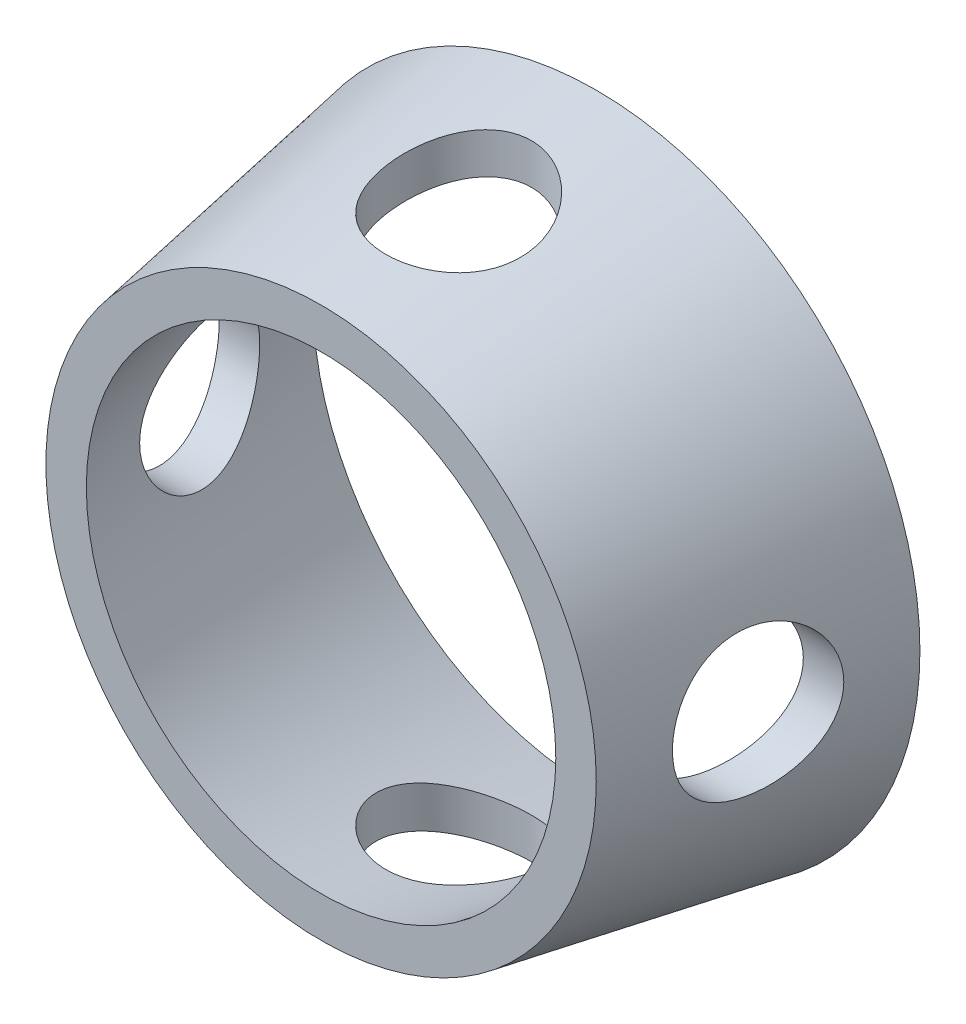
from build123d import *

# Parameters (mm, degrees)
SKETCH1_R               = 20
BOSS_EXTRUDE1_DEPTH     = 17
BOSS_EXTRUDE1_TAPER     = 10
SKETCH3_R               = 17.5
CUT_EXTRUDE1_DEPTH      = 17
CUT_EXTRUDE1_DRAFT      = -10
CUT_EXTRUDE2_DEPTH      = 17
CUT_EXTRUDE2_DEPTH_BACK = 46.92098479
SKETCH4_R               = 4.5
CUT_EXTRUDE3_DEPTH      = 46.931942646
CUT_EXTRUDE3_DEPTH_BACK = 46.931942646
SKETCH5_R               = 4.5


with BuildPart() as part:
    # Sketch1 → Boss-Extrude1 (new body)
    with BuildSketch(Plane.XY):
        Circle(SKETCH1_R)
    extrude(amount=BOSS_EXTRUDE1_DEPTH, taper=BOSS_EXTRUDE1_TAPER)


with BuildPart() as cut_extrude1_tool:
    # Sketch3 → Cut-Extrude1 (with draft: the straight prism first)
    with BuildSketch(Plane(origin=(0, 0, 0), x_dir=(-1, 0, 0), z_dir=(0, 0, -1))):
        Circle(SKETCH3_R)
    extrude(amount=-CUT_EXTRUDE1_DEPTH)
    # Cut-Extrude1: the draft: its side faces are tilted about the plane it starts from
    cut_extrude1_sides = [cut_extrude1_tool.faces().sort_by_distance(p)[0] for p in [
        (17.5, 0, 8.5),
    ]]
    draft(cut_extrude1_sides, Plane(origin=(0, 0, 0), x_dir=(-1, 0, 0), z_dir=(0, 0, -1)), CUT_EXTRUDE1_DRAFT)


with BuildPart() as part_1:
    add(part.part)

    # Cut-Extrude1: cut by cut_extrude1_tool
    add(cut_extrude1_tool.part, mode=Mode.SUBTRACT)

    # Sketch4 → Cut-Extrude2 (cut, two sides: drawn at the far end of the back side and taken through both)
    with BuildSketch(Plane.XZ.offset(17.679395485).offset(-CUT_EXTRUDE2_DEPTH_BACK)):
        with Locations(Location((0, 8.5, 0), (0, 0, 233.171174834))):
            Circle(SKETCH4_R)
    extrude(amount=CUT_EXTRUDE2_DEPTH + CUT_EXTRUDE2_DEPTH_BACK, mode=Mode.SUBTRACT)

    # Sketch5 → Cut-Extrude3 (cut, two sides: drawn at the far end of the back side and taken through both)
    with BuildSketch(Plane(origin=(17.692749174, 0, 0), x_dir=(0, 0, -1), z_dir=(1, 0, 0)).offset(-CUT_EXTRUDE3_DEPTH_BACK)):
        with Locations(Location((-8.5, 0, 0), (0, 0, 311.824793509))):
            Circle(SKETCH5_R)
    extrude(amount=CUT_EXTRUDE3_DEPTH + CUT_EXTRUDE3_DEPTH_BACK, mode=Mode.SUBTRACT)


solid = part_1.part
